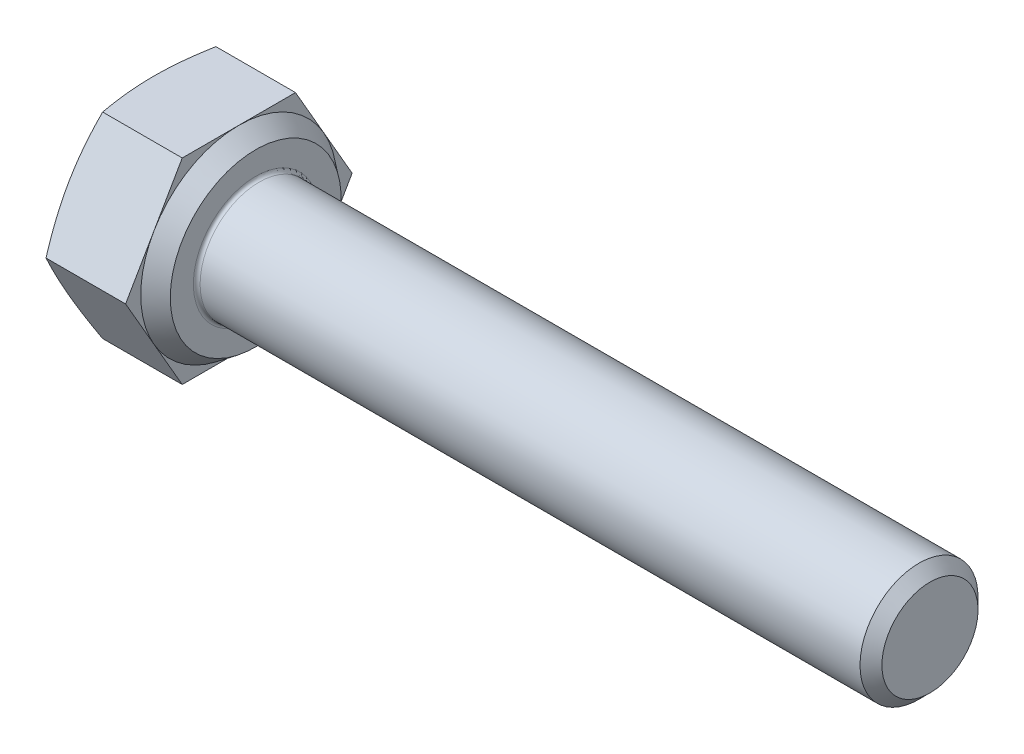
from build123d import *

# Parameters (mm, degrees)
BASEHEAD_DEPTH = 2.525
SKETCH3_R      = 1.75
BASEBODY_DEPTH = 20
HEADFILLET_R   = 0.1
CHAMFER1_SIZE  = 0.325


with BuildPart() as part:
    # Sketch-BaseHead → BaseHead (new body)
    with BuildSketch(Plane(origin=(0, 0, 0), x_dir=(0, 0, -1), z_dir=(1, 0, 0))):
        Polygon((3.360178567, 0), (1.680089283, 2.91), (-1.680089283, 2.91), (-3.360178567, 0), (-1.680089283, -2.91), (1.680089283, -2.91), align=None)
    extrude(amount=BASEHEAD_DEPTH)

    # Sketch4 → HeadChamfer (revolve, cut)
    with BuildSketch(Plane(origin=(-0.264637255, 0, 5.916896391), x_dir=(0, 0, -1), z_dir=(0, 1, 0))):
        Polygon((9.277074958, -0.264637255), (8.826896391, -0.264637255), (9.277074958, -0.428488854), align=None)
    revolve(axis=Axis((-4.001564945, 0, 0), (1, 0, 0)), mode=Mode.SUBTRACT)

    # Sketch1 → Revolve1 (revolve)
    with BuildSketch(Plane.XY, mode=Mode.PRIVATE) as revolve1_sk:
        Polygon((2.525, 0), (3.025, 0), (3.025, -2.535), (2.525, -2.91), align=None)
    revolve(revolve1_sk.sketch.rotate(Axis((-4.001564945, 0, 0), (1, 0, 0)), 270), axis=Axis((-4.001564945, 0, 0), (1, 0, 0)))

    # Sketch3 → BaseBody (add)
    with BuildSketch(Plane(origin=(3.025, 0, 0), x_dir=(0, 0, -1), z_dir=(1, 0, 0))):
        Circle(SKETCH3_R)
    extrude(amount=BASEBODY_DEPTH)

    # HeadFillet
    headfillet_edges = [part.edges().sort_by_distance(p)[0] for p in [
        (3.025, 0, 1.75),
    ]]
    fillet(headfillet_edges, radius=HEADFILLET_R)

    # Chamfer1
    chamfer1_edges = [part.edges().sort_by_distance(p)[0] for p in [
        (23.025, 0, 1.75),
    ]]
    chamfer(chamfer1_edges, length=CHAMFER1_SIZE)


solid = part.part
